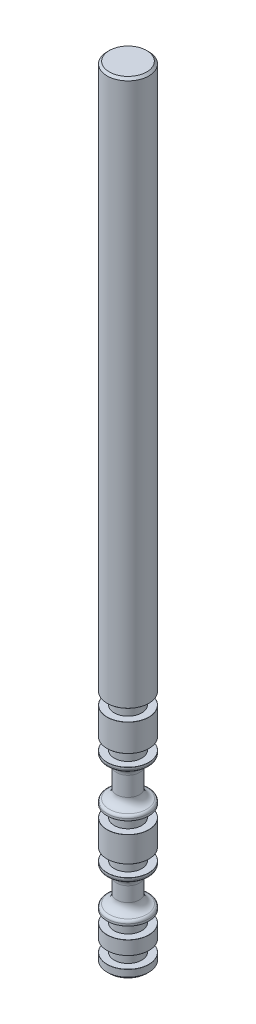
from build123d import *

# Parameters (mm, degrees)
SKETCH1_W     = 2.295
SKETCH1_H     = 85.69
FILLET1_R     = 1
FILLET2_R     = 0.3
CHAMFER1_SIZE = 0.01
CHAMFER2_SIZE = 0.25


with BuildPart() as part:
    # Sketch1 → Revolve1 (revolve)
    with BuildSketch(Plane.XY, mode=Mode.PRIVATE) as revolve1_sk:
        with Locations((1.1475, 42.845)):
            Rectangle(SKETCH1_W, SKETCH1_H)
    revolve(revolve1_sk.sketch.rotate(Axis((0, -5.946636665, 0), (0, 1, 0)), 90), axis=Axis((0, -5.946636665, 0), (0, 1, 0)))

    # Sketch2 → Cut-Revolve3 (revolve, cut)
    with BuildSketch(Plane.XY, mode=Mode.PRIVATE) as cut_revolve3_sk:
        Polygon((1.51, 21.5), (2.538451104, 21.5), (2.538451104, 24.5), (1.51, 24.5), (1.51, 25.8), (3.819489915, 25.8), (3.819489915, 1), (1.51, 1), (1.51, 2.3), (2.538451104, 2.3), (2.538451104, 3.8), (1.51, 3.8), (1.51, 5.1), (2.538451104, 5.1), (2.538451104, 5.6), (1.25, 5.6), (1.25, 9.2), (2.538451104, 9.2), (2.538451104, 9.7), (1.51, 9.7), (1.51, 11), (2.538451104, 11), (2.538451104, 13.8), (1.51, 13.8), (1.51, 15.1), (2.538451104, 15.1), (2.538451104, 15.6), (1.25, 15.6), (1.25, 19.7), (2.538451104, 19.7), (2.538451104, 20.2), (1.51, 20.2), align=None)
    revolve(cut_revolve3_sk.sketch.rotate(Axis((0, 86.365687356, 0), (0, -1, 0)), 270), axis=Axis((0, 86.365687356, 0), (0, -1, 0)), mode=Mode.SUBTRACT)

    # Fillet1
    fillet1_edges = [part.edges().sort_by_distance(p)[0] for p in [
        (0, 9.2, 1.25),
        (0, 5.6, 1.25),
        (0, 19.7, 1.25),
        (0, 15.6, 1.25),
    ]]
    fillet(fillet1_edges, radius=FILLET1_R)

    # Fillet2
    fillet2_edges = [part.edges().sort_by_distance(p)[0] for p in [
        (0, 19.7, 2.295),
        (0, 15.6, 2.295),
        (0, 9.2, 2.295),
        (0, 5.6, 2.295),
    ]]
    fillet(fillet2_edges, radius=FILLET2_R)

    # Chamfer1
    chamfer1_edges = [part.edges().sort_by_distance(p)[0] for p in [
        (0, 15.1, 2.295),
        (0, 13.8, 2.295),
        (0, 11, 2.295),
        (0, 9.7, 2.295),
        (0, 5.1, 2.295),
        (0, 3.8, 2.295),
        (0, 2.3, 2.295),
        (0, 1, 2.295),
        (0, 25.8, 2.295),
        (0, 24.5, 2.295),
        (0, 21.5, 2.295),
        (0, 20.2, 2.295),
    ]]
    chamfer(chamfer1_edges, length=CHAMFER1_SIZE)

    # Chamfer2
    chamfer2_edges = [part.edges().sort_by_distance(p)[0] for p in [
        (0, 0, 2.295),
        (0, 85.69, 2.295),
    ]]
    chamfer(chamfer2_edges, length=CHAMFER2_SIZE)


solid = part.part
